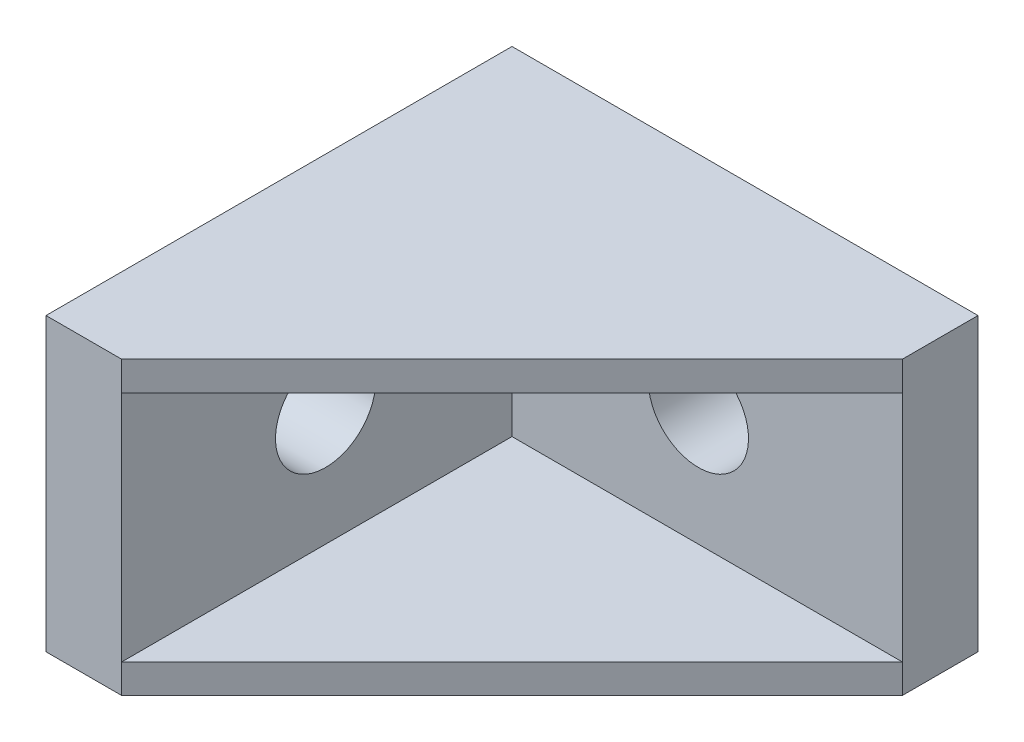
ISO-10303-21;
HEADER;
FILE_DESCRIPTION(('STEP AP214'),'2;1');
FILE_NAME('part.step','',(''),(''),'','','');
FILE_SCHEMA(('AUTOMOTIVE_DESIGN { 1 0 10303 214 1 1 1 1 }'));
ENDSEC;
DATA;
#1=APPLICATION_CONTEXT('core data for automotive mechanical design processes');
#2=APPLICATION_PROTOCOL_DEFINITION('international standard','automotive_design',2000,#1);
#3=PRODUCT_CONTEXT('',#1,'mechanical');
#4=PRODUCT('Part','Part','',(#3));
#5=PRODUCT_RELATED_PRODUCT_CATEGORY('part','',(#4));
#6=PRODUCT_DEFINITION_FORMATION('','',#4);
#7=PRODUCT_DEFINITION_CONTEXT('part definition',#1,'design');
#8=PRODUCT_DEFINITION('design','',#6,#7);
#9=PRODUCT_DEFINITION_SHAPE('','',#8);
#10=(LENGTH_UNIT() NAMED_UNIT(*) SI_UNIT(.MILLI.,.METRE.));
#11=(NAMED_UNIT(*) PLANE_ANGLE_UNIT() SI_UNIT($,.RADIAN.));
#12=(NAMED_UNIT(*) SI_UNIT($,.STERADIAN.) SOLID_ANGLE_UNIT());
#13=UNCERTAINTY_MEASURE_WITH_UNIT(LENGTH_MEASURE(1.E-05),#10,'distance_accuracy_value','');
#14=(GEOMETRIC_REPRESENTATION_CONTEXT(3) GLOBAL_UNCERTAINTY_ASSIGNED_CONTEXT((#13)) GLOBAL_UNIT_ASSIGNED_CONTEXT((#10,
#11,#12)) REPRESENTATION_CONTEXT('',''));
#15=CARTESIAN_POINT('',(0.,0.,0.));
#16=DIRECTION('',(0.,0.,1.));
#17=DIRECTION('',(1.,0.,0.));
#18=AXIS2_PLACEMENT_3D('',#15,#16,#17);
#19=CARTESIAN_POINT('',(20.,0.,-2.));
#20=DIRECTION('',(0.,0.,1.));
#21=DIRECTION('',(1.,0.,0.));
#22=AXIS2_PLACEMENT_3D('',#19,#20,#21);
#23=PLANE('',#22);
#24=DIRECTION('',(1.,0.,0.));
#25=VECTOR('',#24,1.);
#26=CARTESIAN_POINT('',(20.,4.1,-2.));
#27=LINE('',#26,#25);
#28=CARTESIAN_POINT('',(23.7961481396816,4.1,-2.));
#29=VERTEX_POINT('',#28);
#30=CARTESIAN_POINT('',(36.,4.1,-2.));
#31=VERTEX_POINT('',#30);
#32=EDGE_CURVE('E178',#29,#31,#27,.T.);
#33=ORIENTED_EDGE('',*,*,#32,.T.);
#34=DIRECTION('',(0.,1.,0.));
#35=VECTOR('',#34,1.);
#36=CARTESIAN_POINT('',(36.,0.,-2.));
#37=LINE('',#36,#35);
#38=CARTESIAN_POINT('',(36.,-4.1,-2.));
#39=VERTEX_POINT('',#38);
#40=EDGE_CURVE('E239',#31,#39,#37,.F.);
#41=ORIENTED_EDGE('',*,*,#40,.T.);
#42=DIRECTION('',(1.,0.,0.));
#43=VECTOR('',#42,1.);
#44=CARTESIAN_POINT('',(20.,-4.1,-2.));
#45=LINE('',#44,#43);
#46=CARTESIAN_POINT('',(23.7961481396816,-4.1,-2.));
#47=VERTEX_POINT('',#46);
#48=EDGE_CURVE('E174',#47,#39,#45,.T.);
#49=ORIENTED_EDGE('',*,*,#48,.F.);
#50=CARTESIAN_POINT('',(22.5,0.,-2.));
#51=DIRECTION('',(0.,0.,-1.));
#52=DIRECTION('',(0.,1.,0.));
#53=AXIS2_PLACEMENT_3D('',#50,#51,#52);
#54=CIRCLE('',#53,4.3);
#55=EDGE_CURVE('E18',#47,#29,#54,.F.);
#56=ORIENTED_EDGE('',*,*,#55,.T.);
#57=EDGE_LOOP('',(#33,#41,#49,#56));
#58=FACE_BOUND('',#57,.T.);
#59=ADVANCED_FACE('F15',(#58),#23,.F.);
#60=CARTESIAN_POINT('',(20.,0.,-2.));
#61=DIRECTION('',(0.,0.,1.));
#62=DIRECTION('',(1.,0.,0.));
#63=AXIS2_PLACEMENT_3D('',#60,#61,#62);
#64=PLANE('',#63);
#65=DIRECTION('',(1.,0.,0.));
#66=VECTOR('',#65,1.);
#67=CARTESIAN_POINT('',(20.,-4.1,-2.));
#68=LINE('',#67,#66);
#69=CARTESIAN_POINT('',(4.,-4.1,-2.));
#70=VERTEX_POINT('',#69);
#71=CARTESIAN_POINT('',(21.2038518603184,-4.1,-2.));
#72=VERTEX_POINT('',#71);
#73=EDGE_CURVE('E218',#70,#72,#68,.T.);
#74=ORIENTED_EDGE('',*,*,#73,.F.);
#75=DIRECTION('',(0.,1.,0.));
#76=VECTOR('',#75,1.);
#77=CARTESIAN_POINT('',(4.,0.,-2.));
#78=LINE('',#77,#76);
#79=CARTESIAN_POINT('',(4.,4.1,-2.));
#80=VERTEX_POINT('',#79);
#81=EDGE_CURVE('E210',#70,#80,#78,.T.);
#82=ORIENTED_EDGE('',*,*,#81,.T.);
#83=DIRECTION('',(1.,0.,0.));
#84=VECTOR('',#83,1.);
#85=CARTESIAN_POINT('',(20.,4.1,-2.));
#86=LINE('',#85,#84);
#87=CARTESIAN_POINT('',(21.2038518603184,4.1,-2.));
#88=VERTEX_POINT('',#87);
#89=EDGE_CURVE('E191',#80,#88,#86,.T.);
#90=ORIENTED_EDGE('',*,*,#89,.T.);
#91=CARTESIAN_POINT('',(22.5,0.,-2.));
#92=DIRECTION('',(0.,0.,-1.));
#93=DIRECTION('',(0.,1.,0.));
#94=AXIS2_PLACEMENT_3D('',#91,#92,#93);
#95=CIRCLE('',#94,4.3);
#96=EDGE_CURVE('E202',#88,#72,#95,.F.);
#97=ORIENTED_EDGE('',*,*,#96,.T.);
#98=EDGE_LOOP('',(#74,#82,#90,#97));
#99=FACE_BOUND('',#98,.T.);
#100=ADVANCED_FACE('F532',(#99),#64,.F.);
#101=CARTESIAN_POINT('',(15.5483714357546,10.,15.5483714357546));
#102=DIRECTION('',(0.,-1.,0.));
#103=DIRECTION('',(0.,0.,-1.));
#104=AXIS2_PLACEMENT_3D('',#101,#102,#103);
#105=PLANE('',#104);
#106=DIRECTION('',(-1.,0.,0.));
#107=VECTOR('',#106,1.);
#108=CARTESIAN_POINT('',(20.,10.,6.5));
#109=LINE('',#108,#107);
#110=CARTESIAN_POINT('',(6.5,10.,6.5));
#111=VERTEX_POINT('',#110);
#112=CARTESIAN_POINT('',(40.,10.,6.5));
#113=VERTEX_POINT('',#112);
#114=EDGE_CURVE('E276',#111,#113,#109,.F.);
#115=ORIENTED_EDGE('',*,*,#114,.T.);
#116=DIRECTION('',(0.707106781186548,0.,-0.707106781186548));
#117=VECTOR('',#116,1.);
#118=CARTESIAN_POINT('',(6.5,10.,40.));
#119=LINE('',#118,#117);
#120=CARTESIAN_POINT('',(6.5,10.,40.));
#121=VERTEX_POINT('',#120);
#122=EDGE_CURVE('E326',#121,#113,#119,.T.);
#123=ORIENTED_EDGE('',*,*,#122,.F.);
#124=DIRECTION('',(0.,0.,1.));
#125=VECTOR('',#124,1.);
#126=CARTESIAN_POINT('',(6.5,10.,20.));
#127=LINE('',#126,#125);
#128=EDGE_CURVE('E324',#121,#111,#127,.F.);
#129=ORIENTED_EDGE('',*,*,#128,.T.);
#130=EDGE_LOOP('',(#115,#123,#129));
#131=FACE_BOUND('',#130,.T.);
#132=ADVANCED_FACE('F459',(#131),#105,.T.);
#133=CARTESIAN_POINT('',(-2.,0.,20.));
#134=DIRECTION('',(1.,0.,0.));
#135=DIRECTION('',(0.,0.,-1.));
#136=AXIS2_PLACEMENT_3D('',#133,#134,#135);
#137=PLANE('',#136);
#138=DIRECTION('',(0.,0.,-1.));
#139=VECTOR('',#138,1.);
#140=CARTESIAN_POINT('',(-2.,4.1,20.));
#141=LINE('',#140,#139);
#142=CARTESIAN_POINT('',(-2.,4.1,21.2038518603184));
#143=VERTEX_POINT('',#142);
#144=CARTESIAN_POINT('',(-2.,4.1,4.));
#145=VERTEX_POINT('',#144);
#146=EDGE_CURVE('E226',#143,#145,#141,.T.);
#147=ORIENTED_EDGE('',*,*,#146,.T.);
#148=DIRECTION('',(0.,1.,0.));
#149=VECTOR('',#148,1.);
#150=CARTESIAN_POINT('',(-2.,0.,4.));
#151=LINE('',#150,#149);
#152=CARTESIAN_POINT('',(-2.,-4.1,4.));
#153=VERTEX_POINT('',#152);
#154=EDGE_CURVE('E234',#145,#153,#151,.F.);
#155=ORIENTED_EDGE('',*,*,#154,.T.);
#156=DIRECTION('',(0.,0.,-1.));
#157=VECTOR('',#156,1.);
#158=CARTESIAN_POINT('',(-2.,-4.1,20.));
#159=LINE('',#158,#157);
#160=CARTESIAN_POINT('',(-2.,-4.1,21.2038518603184));
#161=VERTEX_POINT('',#160);
#162=EDGE_CURVE('E230',#161,#153,#159,.T.);
#163=ORIENTED_EDGE('',*,*,#162,.F.);
#164=CARTESIAN_POINT('',(-2.,0.,22.5));
#165=DIRECTION('',(1.,0.,0.));
#166=DIRECTION('',(0.,0.,-1.));
#167=AXIS2_PLACEMENT_3D('',#164,#165,#166);
#168=CIRCLE('',#167,4.3);
#169=EDGE_CURVE('E269',#161,#143,#168,.T.);
#170=ORIENTED_EDGE('',*,*,#169,.T.);
#171=EDGE_LOOP('',(#147,#155,#163,#170));
#172=FACE_BOUND('',#171,.T.);
#173=ADVANCED_FACE('F435',(#172),#137,.F.);
#174=CARTESIAN_POINT('',(-2.,0.,20.));
#175=DIRECTION('',(1.,0.,0.));
#176=DIRECTION('',(0.,0.,-1.));
#177=AXIS2_PLACEMENT_3D('',#174,#175,#176);
#178=PLANE('',#177);
#179=DIRECTION('',(0.,0.,-1.));
#180=VECTOR('',#179,1.);
#181=CARTESIAN_POINT('',(-2.,-4.1,20.));
#182=LINE('',#181,#180);
#183=CARTESIAN_POINT('',(-2.,-4.1,36.));
#184=VERTEX_POINT('',#183);
#185=CARTESIAN_POINT('',(-2.,-4.1,23.7961481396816));
#186=VERTEX_POINT('',#185);
#187=EDGE_CURVE('E219',#184,#186,#182,.T.);
#188=ORIENTED_EDGE('',*,*,#187,.F.);
#189=DIRECTION('',(0.,1.,0.));
#190=VECTOR('',#189,1.);
#191=CARTESIAN_POINT('',(-2.,0.,36.));
#192=LINE('',#191,#190);
#193=CARTESIAN_POINT('',(-2.,4.1,36.));
#194=VERTEX_POINT('',#193);
#195=EDGE_CURVE('E236',#184,#194,#192,.T.);
#196=ORIENTED_EDGE('',*,*,#195,.T.);
#197=DIRECTION('',(0.,0.,-1.));
#198=VECTOR('',#197,1.);
#199=CARTESIAN_POINT('',(-2.,4.1,20.));
#200=LINE('',#199,#198);
#201=CARTESIAN_POINT('',(-2.,4.1,23.7961481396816));
#202=VERTEX_POINT('',#201);
#203=EDGE_CURVE('E224',#194,#202,#200,.T.);
#204=ORIENTED_EDGE('',*,*,#203,.T.);
#205=CARTESIAN_POINT('',(-2.,0.,22.5));
#206=DIRECTION('',(1.,0.,0.));
#207=DIRECTION('',(0.,0.,-1.));
#208=AXIS2_PLACEMENT_3D('',#205,#206,#207);
#209=CIRCLE('',#208,4.3);
#210=EDGE_CURVE('E266',#202,#186,#209,.T.);
#211=ORIENTED_EDGE('',*,*,#210,.T.);
#212=EDGE_LOOP('',(#188,#196,#204,#211));
#213=FACE_BOUND('',#212,.T.);
#214=ADVANCED_FACE('F448',(#213),#178,.F.);
#215=CARTESIAN_POINT('',(20.,-4.1,-1.));
#216=DIRECTION('',(0.,-1.,0.));
#217=DIRECTION('',(0.,0.,-1.));
#218=AXIS2_PLACEMENT_3D('',#215,#216,#217);
#219=PLANE('',#218);
#220=DIRECTION('',(0.,0.,-1.));
#221=VECTOR('',#220,1.);
#222=CARTESIAN_POINT('',(4.,-4.1,-1.));
#223=LINE('',#222,#221);
#224=CARTESIAN_POINT('',(4.,-4.1,0.));
#225=VERTEX_POINT('',#224);
#226=EDGE_CURVE('E215',#225,#70,#223,.T.);
#227=ORIENTED_EDGE('',*,*,#226,.T.);
#228=ORIENTED_EDGE('',*,*,#73,.T.);
#229=DIRECTION('',(0.,0.,-1.));
#230=VECTOR('',#229,1.);
#231=CARTESIAN_POINT('',(21.2038518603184,-4.1,2.25));
#232=LINE('',#231,#230);
#233=CARTESIAN_POINT('',(21.2038518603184,-4.1,0.));
#234=VERTEX_POINT('',#233);
#235=EDGE_CURVE('E277',#72,#234,#232,.F.);
#236=ORIENTED_EDGE('',*,*,#235,.T.);
#237=DIRECTION('',(1.,0.,0.));
#238=VECTOR('',#237,1.);
#239=CARTESIAN_POINT('',(20.,-4.1,0.));
#240=LINE('',#239,#238);
#241=EDGE_CURVE('E214',#234,#225,#240,.F.);
#242=ORIENTED_EDGE('',*,*,#241,.T.);
#243=EDGE_LOOP('',(#227,#228,#236,#242));
#244=FACE_BOUND('',#243,.T.);
#245=ADVANCED_FACE('F450',(#244),#219,.T.);
#246=CARTESIAN_POINT('',(4.,0.,-1.));
#247=DIRECTION('',(1.,0.,0.));
#248=DIRECTION('',(0.,0.,-1.));
#249=AXIS2_PLACEMENT_3D('',#246,#247,#248);
#250=PLANE('',#249);
#251=DIRECTION('',(0.,0.,-1.));
#252=VECTOR('',#251,1.);
#253=CARTESIAN_POINT('',(4.,4.1,-1.));
#254=LINE('',#253,#252);
#255=CARTESIAN_POINT('',(4.,4.1,0.));
#256=VERTEX_POINT('',#255);
#257=EDGE_CURVE('E207',#256,#80,#254,.T.);
#258=ORIENTED_EDGE('',*,*,#257,.T.);
#259=ORIENTED_EDGE('',*,*,#81,.F.);
#260=ORIENTED_EDGE('',*,*,#226,.F.);
#261=DIRECTION('',(0.,1.,0.));
#262=VECTOR('',#261,1.);
#263=CARTESIAN_POINT('',(4.,0.,0.));
#264=LINE('',#263,#262);
#265=EDGE_CURVE('E211',#225,#256,#264,.T.);
#266=ORIENTED_EDGE('',*,*,#265,.T.);
#267=EDGE_LOOP('',(#258,#259,#260,#266));
#268=FACE_BOUND('',#267,.T.);
#269=ADVANCED_FACE('F457',(#268),#250,.F.);
#270=CARTESIAN_POINT('',(20.,4.1,-1.));
#271=DIRECTION('',(0.,-1.,0.));
#272=DIRECTION('',(0.,0.,-1.));
#273=AXIS2_PLACEMENT_3D('',#270,#271,#272);
#274=PLANE('',#273);
#275=ORIENTED_EDGE('',*,*,#89,.F.);
#276=ORIENTED_EDGE('',*,*,#257,.F.);
#277=DIRECTION('',(1.,0.,0.));
#278=VECTOR('',#277,1.);
#279=CARTESIAN_POINT('',(20.,4.1,0.));
#280=LINE('',#279,#278);
#281=CARTESIAN_POINT('',(21.2038518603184,4.1,0.));
#282=VERTEX_POINT('',#281);
#283=EDGE_CURVE('E213',#256,#282,#280,.T.);
#284=ORIENTED_EDGE('',*,*,#283,.T.);
#285=DIRECTION('',(0.,0.,-1.));
#286=VECTOR('',#285,1.);
#287=CARTESIAN_POINT('',(21.2038518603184,4.1,2.25));
#288=LINE('',#287,#286);
#289=EDGE_CURVE('E199',#282,#88,#288,.T.);
#290=ORIENTED_EDGE('',*,*,#289,.T.);
#291=EDGE_LOOP('',(#275,#276,#284,#290));
#292=FACE_BOUND('',#291,.T.);
#293=ADVANCED_FACE('F518',(#292),#274,.F.);
#294=CARTESIAN_POINT('',(20.,4.1,-1.));
#295=DIRECTION('',(0.,-1.,0.));
#296=DIRECTION('',(0.,0.,-1.));
#297=AXIS2_PLACEMENT_3D('',#294,#295,#296);
#298=PLANE('',#297);
#299=DIRECTION('',(1.,0.,0.));
#300=VECTOR('',#299,1.);
#301=CARTESIAN_POINT('',(20.,4.1,0.));
#302=LINE('',#301,#300);
#303=CARTESIAN_POINT('',(23.7961481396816,4.1,0.));
#304=VERTEX_POINT('',#303);
#305=CARTESIAN_POINT('',(36.,4.1,0.));
#306=VERTEX_POINT('',#305);
#307=EDGE_CURVE('E260',#304,#306,#302,.T.);
#308=ORIENTED_EDGE('',*,*,#307,.T.);
#309=DIRECTION('',(0.,0.,1.));
#310=VECTOR('',#309,1.);
#311=CARTESIAN_POINT('',(36.,4.1,-1.));
#312=LINE('',#311,#310);
#313=EDGE_CURVE('E189',#306,#31,#312,.F.);
#314=ORIENTED_EDGE('',*,*,#313,.T.);
#315=ORIENTED_EDGE('',*,*,#32,.F.);
#316=DIRECTION('',(0.,0.,-1.));
#317=VECTOR('',#316,1.);
#318=CARTESIAN_POINT('',(23.7961481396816,4.1,2.25));
#319=LINE('',#318,#317);
#320=EDGE_CURVE('E183',#29,#304,#319,.F.);
#321=ORIENTED_EDGE('',*,*,#320,.T.);
#322=EDGE_LOOP('',(#308,#314,#315,#321));
#323=FACE_BOUND('',#322,.T.);
#324=ADVANCED_FACE('F186',(#323),#298,.F.);
#325=CARTESIAN_POINT('',(36.,0.,-1.));
#326=DIRECTION('',(-1.,0.,0.));
#327=DIRECTION('',(0.,0.,1.));
#328=AXIS2_PLACEMENT_3D('',#325,#326,#327);
#329=PLANE('',#328);
#330=ORIENTED_EDGE('',*,*,#313,.F.);
#331=DIRECTION('',(0.,1.,0.));
#332=VECTOR('',#331,1.);
#333=CARTESIAN_POINT('',(36.,0.,0.));
#334=LINE('',#333,#332);
#335=CARTESIAN_POINT('',(36.,-4.1,0.));
#336=VERTEX_POINT('',#335);
#337=EDGE_CURVE('E289',#306,#336,#334,.F.);
#338=ORIENTED_EDGE('',*,*,#337,.T.);
#339=DIRECTION('',(0.,0.,-1.));
#340=VECTOR('',#339,1.);
#341=CARTESIAN_POINT('',(36.,-4.1,-1.));
#342=LINE('',#341,#340);
#343=EDGE_CURVE('E184',#39,#336,#342,.F.);
#344=ORIENTED_EDGE('',*,*,#343,.F.);
#345=ORIENTED_EDGE('',*,*,#40,.F.);
#346=EDGE_LOOP('',(#330,#338,#344,#345));
#347=FACE_BOUND('',#346,.T.);
#348=ADVANCED_FACE('F512',(#347),#329,.F.);
#349=CARTESIAN_POINT('',(20.,-4.1,-1.));
#350=DIRECTION('',(0.,-1.,0.));
#351=DIRECTION('',(0.,0.,-1.));
#352=AXIS2_PLACEMENT_3D('',#349,#350,#351);
#353=PLANE('',#352);
#354=ORIENTED_EDGE('',*,*,#343,.T.);
#355=DIRECTION('',(1.,0.,0.));
#356=VECTOR('',#355,1.);
#357=CARTESIAN_POINT('',(20.,-4.1,0.));
#358=LINE('',#357,#356);
#359=CARTESIAN_POINT('',(23.7961481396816,-4.1,0.));
#360=VERTEX_POINT('',#359);
#361=EDGE_CURVE('E258',#336,#360,#358,.F.);
#362=ORIENTED_EDGE('',*,*,#361,.T.);
#363=DIRECTION('',(0.,0.,-1.));
#364=VECTOR('',#363,1.);
#365=CARTESIAN_POINT('',(23.7961481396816,-4.1,2.25));
#366=LINE('',#365,#364);
#367=EDGE_CURVE('E280',#360,#47,#366,.T.);
#368=ORIENTED_EDGE('',*,*,#367,.T.);
#369=ORIENTED_EDGE('',*,*,#48,.T.);
#370=EDGE_LOOP('',(#354,#362,#368,#369));
#371=FACE_BOUND('',#370,.T.);
#372=ADVANCED_FACE('F508',(#371),#353,.T.);
#373=CARTESIAN_POINT('',(22.5,0.,2.25));
#374=DIRECTION('',(0.,0.,-1.));
#375=DIRECTION('',(0.,1.,0.));
#376=AXIS2_PLACEMENT_3D('',#373,#374,#375);
#377=CYLINDRICAL_SURFACE('',#376,4.3);
#378=CARTESIAN_POINT('',(22.5,0.,6.5));
#379=DIRECTION('',(0.,0.,-1.));
#380=DIRECTION('',(0.,1.,0.));
#381=AXIS2_PLACEMENT_3D('',#378,#379,#380);
#382=CIRCLE('',#381,4.3);
#383=CARTESIAN_POINT('',(22.5,4.3,6.5));
#384=VERTEX_POINT('',#383);
#385=EDGE_CURVE('E273',#384,#384,#382,.F.);
#386=ORIENTED_EDGE('',*,*,#385,.T.);
#387=EDGE_LOOP('',(#386));
#388=FACE_BOUND('',#387,.T.);
#389=CARTESIAN_POINT('',(22.5,0.,0.));
#390=DIRECTION('',(0.,0.,-1.));
#391=DIRECTION('',(0.,1.,0.));
#392=AXIS2_PLACEMENT_3D('',#389,#390,#391);
#393=CIRCLE('',#392,4.3);
#394=EDGE_CURVE('E255',#360,#234,#393,.T.);
#395=ORIENTED_EDGE('',*,*,#394,.T.);
#396=ORIENTED_EDGE('',*,*,#235,.F.);
#397=ORIENTED_EDGE('',*,*,#96,.F.);
#398=ORIENTED_EDGE('',*,*,#289,.F.);
#399=CARTESIAN_POINT('',(22.5,0.,0.));
#400=DIRECTION('',(0.,0.,-1.));
#401=DIRECTION('',(0.,1.,0.));
#402=AXIS2_PLACEMENT_3D('',#399,#400,#401);
#403=CIRCLE('',#402,4.3);
#404=EDGE_CURVE('E197',#282,#304,#403,.T.);
#405=ORIENTED_EDGE('',*,*,#404,.T.);
#406=ORIENTED_EDGE('',*,*,#320,.F.);
#407=ORIENTED_EDGE('',*,*,#55,.F.);
#408=ORIENTED_EDGE('',*,*,#367,.F.);
#409=EDGE_LOOP('',(#395,#396,#397,#398,#405,#406,#407,#408));
#410=FACE_BOUND('',#409,.T.);
#411=ADVANCED_FACE('F194',(#388,#410),#377,.F.);
#412=CARTESIAN_POINT('',(20.,0.,6.5));
#413=DIRECTION('',(0.,0.,-1.));
#414=DIRECTION('',(-1.,0.,0.));
#415=AXIS2_PLACEMENT_3D('',#412,#413,#414);
#416=PLANE('',#415);
#417=ORIENTED_EDGE('',*,*,#385,.F.);
#418=EDGE_LOOP('',(#417));
#419=FACE_BOUND('',#418,.T.);
#420=DIRECTION('',(0.,1.,0.));
#421=VECTOR('',#420,1.);
#422=CARTESIAN_POINT('',(40.,0.,6.5));
#423=LINE('',#422,#421);
#424=CARTESIAN_POINT('',(40.,-10.,6.5));
#425=VERTEX_POINT('',#424);
#426=EDGE_CURVE('E257',#425,#113,#423,.T.);
#427=ORIENTED_EDGE('',*,*,#426,.T.);
#428=ORIENTED_EDGE('',*,*,#114,.F.);
#429=DIRECTION('',(0.,1.,0.));
#430=VECTOR('',#429,1.);
#431=CARTESIAN_POINT('',(6.5,0.,6.5));
#432=LINE('',#431,#430);
#433=CARTESIAN_POINT('',(6.5,-10.,6.5));
#434=VERTEX_POINT('',#433);
#435=EDGE_CURVE('E322',#111,#434,#432,.F.);
#436=ORIENTED_EDGE('',*,*,#435,.T.);
#437=DIRECTION('',(1.,0.,0.));
#438=VECTOR('',#437,1.);
#439=CARTESIAN_POINT('',(15.5483714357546,-10.,6.5));
#440=LINE('',#439,#438);
#441=EDGE_CURVE('E275',#434,#425,#440,.T.);
#442=ORIENTED_EDGE('',*,*,#441,.T.);
#443=EDGE_LOOP('',(#427,#428,#436,#442));
#444=FACE_BOUND('',#443,.T.);
#445=ADVANCED_FACE('F332',(#419,#444),#416,.F.);
#446=CARTESIAN_POINT('',(15.5483714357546,-10.,15.5483714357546));
#447=DIRECTION('',(0.,-1.,0.));
#448=DIRECTION('',(0.,0.,-1.));
#449=AXIS2_PLACEMENT_3D('',#446,#447,#448);
#450=PLANE('',#449);
#451=DIRECTION('',(0.707106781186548,0.,-0.707106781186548));
#452=VECTOR('',#451,1.);
#453=CARTESIAN_POINT('',(6.5,-10.,40.));
#454=LINE('',#453,#452);
#455=CARTESIAN_POINT('',(6.5,-10.,40.));
#456=VERTEX_POINT('',#455);
#457=EDGE_CURVE('E348',#425,#456,#454,.F.);
#458=ORIENTED_EDGE('',*,*,#457,.F.);
#459=ORIENTED_EDGE('',*,*,#441,.F.);
#460=DIRECTION('',(0.,0.,1.));
#461=VECTOR('',#460,1.);
#462=CARTESIAN_POINT('',(6.5,-10.,20.));
#463=LINE('',#462,#461);
#464=EDGE_CURVE('E320',#434,#456,#463,.T.);
#465=ORIENTED_EDGE('',*,*,#464,.T.);
#466=EDGE_LOOP('',(#458,#459,#465));
#467=FACE_BOUND('',#466,.T.);
#468=ADVANCED_FACE('F349',(#467),#450,.F.);
#469=CARTESIAN_POINT('',(6.5,12.5,40.));
#470=DIRECTION('',(0.707106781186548,0.,0.707106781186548));
#471=DIRECTION('',(0.707106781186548,0.,-0.707106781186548));
#472=AXIS2_PLACEMENT_3D('',#469,#470,#471);
#473=PLANE('',#472);
#474=DIRECTION('',(-0.707106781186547,0.,0.707106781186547));
#475=VECTOR('',#474,1.);
#476=CARTESIAN_POINT('',(40.,12.5,6.5));
#477=LINE('',#476,#475);
#478=CARTESIAN_POINT('',(40.,12.5,6.5));
#479=VERTEX_POINT('',#478);
#480=CARTESIAN_POINT('',(6.5,12.5,40.));
#481=VERTEX_POINT('',#480);
#482=EDGE_CURVE('E223',#479,#481,#477,.T.);
#483=ORIENTED_EDGE('',*,*,#482,.T.);
#484=DIRECTION('',(0.,1.,0.));
#485=VECTOR('',#484,1.);
#486=CARTESIAN_POINT('',(6.5,0.,40.));
#487=LINE('',#486,#485);
#488=EDGE_CURVE('E389',#481,#121,#487,.F.);
#489=ORIENTED_EDGE('',*,*,#488,.T.);
#490=ORIENTED_EDGE('',*,*,#122,.T.);
#491=DIRECTION('',(0.,1.,0.));
#492=VECTOR('',#491,1.);
#493=CARTESIAN_POINT('',(40.,0.,6.5));
#494=LINE('',#493,#492);
#495=EDGE_CURVE('E346',#113,#479,#494,.T.);
#496=ORIENTED_EDGE('',*,*,#495,.T.);
#497=EDGE_LOOP('',(#483,#489,#490,#496));
#498=FACE_BOUND('',#497,.T.);
#499=ADVANCED_FACE('F367',(#498),#473,.T.);
#500=CARTESIAN_POINT('',(6.5,0.,20.));
#501=DIRECTION('',(-1.,0.,0.));
#502=DIRECTION('',(0.,0.,1.));
#503=AXIS2_PLACEMENT_3D('',#500,#501,#502);
#504=PLANE('',#503);
#505=CARTESIAN_POINT('',(6.5,0.,22.5));
#506=DIRECTION('',(1.,0.,0.));
#507=DIRECTION('',(0.,0.,-1.));
#508=AXIS2_PLACEMENT_3D('',#505,#506,#507);
#509=CIRCLE('',#508,4.3);
#510=CARTESIAN_POINT('',(6.5,0.,18.2));
#511=VERTEX_POINT('',#510);
#512=EDGE_CURVE('E261',#511,#511,#509,.F.);
#513=ORIENTED_EDGE('',*,*,#512,.T.);
#514=EDGE_LOOP('',(#513));
#515=FACE_BOUND('',#514,.T.);
#516=ORIENTED_EDGE('',*,*,#435,.F.);
#517=ORIENTED_EDGE('',*,*,#128,.F.);
#518=DIRECTION('',(0.,1.,0.));
#519=VECTOR('',#518,1.);
#520=CARTESIAN_POINT('',(6.5,0.,40.));
#521=LINE('',#520,#519);
#522=EDGE_CURVE('E398',#121,#456,#521,.F.);
#523=ORIENTED_EDGE('',*,*,#522,.T.);
#524=ORIENTED_EDGE('',*,*,#464,.F.);
#525=EDGE_LOOP('',(#516,#517,#523,#524));
#526=FACE_BOUND('',#525,.T.);
#527=ADVANCED_FACE('F495',(#515,#526),#504,.F.);
#528=CARTESIAN_POINT('',(20.,12.5,3.25));
#529=DIRECTION('',(0.,-1.,0.));
#530=DIRECTION('',(0.,0.,-1.));
#531=AXIS2_PLACEMENT_3D('',#528,#529,#530);
#532=PLANE('',#531);
#533=DIRECTION('',(1.,0.,0.));
#534=VECTOR('',#533,1.);
#535=CARTESIAN_POINT('',(20.,12.5,0.));
#536=LINE('',#535,#534);
#537=CARTESIAN_POINT('',(40.,12.5,0.));
#538=VERTEX_POINT('',#537);
#539=CARTESIAN_POINT('',(0.,12.5,0.));
#540=VERTEX_POINT('',#539);
#541=EDGE_CURVE('E264',#538,#540,#536,.F.);
#542=ORIENTED_EDGE('',*,*,#541,.T.);
#543=DIRECTION('',(0.,0.,-1.));
#544=VECTOR('',#543,1.);
#545=CARTESIAN_POINT('',(0.,12.5,3.25));
#546=LINE('',#545,#544);
#547=CARTESIAN_POINT('',(0.,12.5,40.));
#548=VERTEX_POINT('',#547);
#549=EDGE_CURVE('E384',#540,#548,#546,.F.);
#550=ORIENTED_EDGE('',*,*,#549,.T.);
#551=DIRECTION('',(-1.,0.,0.));
#552=VECTOR('',#551,1.);
#553=CARTESIAN_POINT('',(3.25,12.5,40.));
#554=LINE('',#553,#552);
#555=EDGE_CURVE('E373',#548,#481,#554,.F.);
#556=ORIENTED_EDGE('',*,*,#555,.T.);
#557=ORIENTED_EDGE('',*,*,#482,.F.);
#558=DIRECTION('',(0.,0.,1.));
#559=VECTOR('',#558,1.);
#560=CARTESIAN_POINT('',(40.,12.5,3.25));
#561=LINE('',#560,#559);
#562=EDGE_CURVE('E360',#479,#538,#561,.F.);
#563=ORIENTED_EDGE('',*,*,#562,.T.);
#564=EDGE_LOOP('',(#542,#550,#556,#557,#563));
#565=FACE_BOUND('',#564,.T.);
#566=ADVANCED_FACE('F371',(#565),#532,.F.);
#567=CARTESIAN_POINT('',(-1.,-4.1,20.));
#568=DIRECTION('',(0.,-1.,0.));
#569=DIRECTION('',(0.,0.,-1.));
#570=AXIS2_PLACEMENT_3D('',#567,#568,#569);
#571=PLANE('',#570);
#572=DIRECTION('',(-1.,0.,0.));
#573=VECTOR('',#572,1.);
#574=CARTESIAN_POINT('',(-1.,-4.1,36.));
#575=LINE('',#574,#573);
#576=CARTESIAN_POINT('',(0.,-4.1,36.));
#577=VERTEX_POINT('',#576);
#578=EDGE_CURVE('E222',#577,#184,#575,.T.);
#579=ORIENTED_EDGE('',*,*,#578,.T.);
#580=ORIENTED_EDGE('',*,*,#187,.T.);
#581=DIRECTION('',(1.,0.,0.));
#582=VECTOR('',#581,1.);
#583=CARTESIAN_POINT('',(2.25,-4.1,23.7961481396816));
#584=LINE('',#583,#582);
#585=CARTESIAN_POINT('',(0.,-4.1,23.7961481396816));
#586=VERTEX_POINT('',#585);
#587=EDGE_CURVE('E265',#186,#586,#584,.T.);
#588=ORIENTED_EDGE('',*,*,#587,.T.);
#589=DIRECTION('',(0.,0.,-1.));
#590=VECTOR('',#589,1.);
#591=CARTESIAN_POINT('',(0.,-4.1,3.25));
#592=LINE('',#591,#590);
#593=EDGE_CURVE('E316',#586,#577,#592,.F.);
#594=ORIENTED_EDGE('',*,*,#593,.T.);
#595=EDGE_LOOP('',(#579,#580,#588,#594));
#596=FACE_BOUND('',#595,.T.);
#597=ADVANCED_FACE('F443',(#596),#571,.T.);
#598=CARTESIAN_POINT('',(-1.,0.,36.));
#599=DIRECTION('',(0.,0.,-1.));
#600=DIRECTION('',(-1.,0.,0.));
#601=AXIS2_PLACEMENT_3D('',#598,#599,#600);
#602=PLANE('',#601);
#603=DIRECTION('',(1.,0.,0.));
#604=VECTOR('',#603,1.);
#605=CARTESIAN_POINT('',(-1.,4.1,36.));
#606=LINE('',#605,#604);
#607=CARTESIAN_POINT('',(0.,4.1,36.));
#608=VERTEX_POINT('',#607);
#609=EDGE_CURVE('E227',#608,#194,#606,.F.);
#610=ORIENTED_EDGE('',*,*,#609,.T.);
#611=ORIENTED_EDGE('',*,*,#195,.F.);
#612=ORIENTED_EDGE('',*,*,#578,.F.);
#613=DIRECTION('',(0.,1.,0.));
#614=VECTOR('',#613,1.);
#615=CARTESIAN_POINT('',(0.,0.,36.));
#616=LINE('',#615,#614);
#617=EDGE_CURVE('E314',#577,#608,#616,.T.);
#618=ORIENTED_EDGE('',*,*,#617,.T.);
#619=EDGE_LOOP('',(#610,#611,#612,#618));
#620=FACE_BOUND('',#619,.T.);
#621=ADVANCED_FACE('F446',(#620),#602,.F.);
#622=CARTESIAN_POINT('',(-1.,4.1,20.));
#623=DIRECTION('',(0.,-1.,0.));
#624=DIRECTION('',(0.,0.,-1.));
#625=AXIS2_PLACEMENT_3D('',#622,#623,#624);
#626=PLANE('',#625);
#627=ORIENTED_EDGE('',*,*,#203,.F.);
#628=ORIENTED_EDGE('',*,*,#609,.F.);
#629=DIRECTION('',(0.,0.,-1.));
#630=VECTOR('',#629,1.);
#631=CARTESIAN_POINT('',(0.,4.1,3.25));
#632=LINE('',#631,#630);
#633=CARTESIAN_POINT('',(0.,4.1,23.7961481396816));
#634=VERTEX_POINT('',#633);
#635=EDGE_CURVE('E254',#608,#634,#632,.T.);
#636=ORIENTED_EDGE('',*,*,#635,.T.);
#637=DIRECTION('',(1.,0.,0.));
#638=VECTOR('',#637,1.);
#639=CARTESIAN_POINT('',(2.25,4.1,23.7961481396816));
#640=LINE('',#639,#638);
#641=EDGE_CURVE('E268',#634,#202,#640,.F.);
#642=ORIENTED_EDGE('',*,*,#641,.T.);
#643=EDGE_LOOP('',(#627,#628,#636,#642));
#644=FACE_BOUND('',#643,.T.);
#645=ADVANCED_FACE('F414',(#644),#626,.F.);
#646=CARTESIAN_POINT('',(-1.,4.1,20.));
#647=DIRECTION('',(0.,-1.,0.));
#648=DIRECTION('',(0.,0.,-1.));
#649=AXIS2_PLACEMENT_3D('',#646,#647,#648);
#650=PLANE('',#649);
#651=DIRECTION('',(0.,0.,-1.));
#652=VECTOR('',#651,1.);
#653=CARTESIAN_POINT('',(0.,4.1,3.25));
#654=LINE('',#653,#652);
#655=CARTESIAN_POINT('',(0.,4.1,21.2038518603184));
#656=VERTEX_POINT('',#655);
#657=CARTESIAN_POINT('',(0.,4.1,4.));
#658=VERTEX_POINT('',#657);
#659=EDGE_CURVE('E253',#656,#658,#654,.T.);
#660=ORIENTED_EDGE('',*,*,#659,.T.);
#661=DIRECTION('',(1.,0.,0.));
#662=VECTOR('',#661,1.);
#663=CARTESIAN_POINT('',(-1.,4.1,4.));
#664=LINE('',#663,#662);
#665=EDGE_CURVE('E229',#658,#145,#664,.F.);
#666=ORIENTED_EDGE('',*,*,#665,.T.);
#667=ORIENTED_EDGE('',*,*,#146,.F.);
#668=DIRECTION('',(1.,0.,0.));
#669=VECTOR('',#668,1.);
#670=CARTESIAN_POINT('',(2.25,4.1,21.2038518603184));
#671=LINE('',#670,#669);
#672=EDGE_CURVE('E271',#143,#656,#671,.T.);
#673=ORIENTED_EDGE('',*,*,#672,.T.);
#674=EDGE_LOOP('',(#660,#666,#667,#673));
#675=FACE_BOUND('',#674,.T.);
#676=ADVANCED_FACE('F428',(#675),#650,.F.);
#677=CARTESIAN_POINT('',(-1.,0.,4.));
#678=DIRECTION('',(0.,0.,1.));
#679=DIRECTION('',(1.,0.,0.));
#680=AXIS2_PLACEMENT_3D('',#677,#678,#679);
#681=PLANE('',#680);
#682=ORIENTED_EDGE('',*,*,#665,.F.);
#683=DIRECTION('',(0.,1.,0.));
#684=VECTOR('',#683,1.);
#685=CARTESIAN_POINT('',(0.,0.,4.));
#686=LINE('',#685,#684);
#687=CARTESIAN_POINT('',(0.,-4.1,4.));
#688=VERTEX_POINT('',#687);
#689=EDGE_CURVE('E305',#658,#688,#686,.F.);
#690=ORIENTED_EDGE('',*,*,#689,.T.);
#691=DIRECTION('',(1.,0.,0.));
#692=VECTOR('',#691,1.);
#693=CARTESIAN_POINT('',(-1.,-4.1,4.));
#694=LINE('',#693,#692);
#695=EDGE_CURVE('E233',#153,#688,#694,.T.);
#696=ORIENTED_EDGE('',*,*,#695,.F.);
#697=ORIENTED_EDGE('',*,*,#154,.F.);
#698=EDGE_LOOP('',(#682,#690,#696,#697));
#699=FACE_BOUND('',#698,.T.);
#700=ADVANCED_FACE('F432',(#699),#681,.F.);
#701=CARTESIAN_POINT('',(-1.,-4.1,20.));
#702=DIRECTION('',(0.,-1.,0.));
#703=DIRECTION('',(0.,0.,-1.));
#704=AXIS2_PLACEMENT_3D('',#701,#702,#703);
#705=PLANE('',#704);
#706=ORIENTED_EDGE('',*,*,#695,.T.);
#707=DIRECTION('',(0.,0.,-1.));
#708=VECTOR('',#707,1.);
#709=CARTESIAN_POINT('',(0.,-4.1,3.25));
#710=LINE('',#709,#708);
#711=CARTESIAN_POINT('',(0.,-4.1,21.2038518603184));
#712=VERTEX_POINT('',#711);
#713=EDGE_CURVE('E249',#688,#712,#710,.F.);
#714=ORIENTED_EDGE('',*,*,#713,.T.);
#715=DIRECTION('',(1.,0.,0.));
#716=VECTOR('',#715,1.);
#717=CARTESIAN_POINT('',(2.25,-4.1,21.2038518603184));
#718=LINE('',#717,#716);
#719=EDGE_CURVE('E272',#712,#161,#718,.F.);
#720=ORIENTED_EDGE('',*,*,#719,.T.);
#721=ORIENTED_EDGE('',*,*,#162,.T.);
#722=EDGE_LOOP('',(#706,#714,#720,#721));
#723=FACE_BOUND('',#722,.T.);
#724=ADVANCED_FACE('F479',(#723),#705,.T.);
#725=CARTESIAN_POINT('',(2.25,0.,22.5));
#726=DIRECTION('',(1.,0.,0.));
#727=DIRECTION('',(0.,0.,-1.));
#728=AXIS2_PLACEMENT_3D('',#725,#726,#727);
#729=CYLINDRICAL_SURFACE('',#728,4.3);
#730=ORIENTED_EDGE('',*,*,#512,.F.);
#731=EDGE_LOOP('',(#730));
#732=FACE_BOUND('',#731,.T.);
#733=ORIENTED_EDGE('',*,*,#210,.F.);
#734=ORIENTED_EDGE('',*,*,#641,.F.);
#735=CARTESIAN_POINT('',(0.,0.,22.5));
#736=DIRECTION('',(1.,0.,0.));
#737=DIRECTION('',(0.,0.,-1.));
#738=AXIS2_PLACEMENT_3D('',#735,#736,#737);
#739=CIRCLE('',#738,4.3);
#740=EDGE_CURVE('E250',#634,#656,#739,.F.);
#741=ORIENTED_EDGE('',*,*,#740,.T.);
#742=ORIENTED_EDGE('',*,*,#672,.F.);
#743=ORIENTED_EDGE('',*,*,#169,.F.);
#744=ORIENTED_EDGE('',*,*,#719,.F.);
#745=CARTESIAN_POINT('',(0.,0.,22.5));
#746=DIRECTION('',(1.,0.,0.));
#747=DIRECTION('',(0.,0.,-1.));
#748=AXIS2_PLACEMENT_3D('',#745,#746,#747);
#749=CIRCLE('',#748,4.3);
#750=EDGE_CURVE('E245',#712,#586,#749,.F.);
#751=ORIENTED_EDGE('',*,*,#750,.T.);
#752=ORIENTED_EDGE('',*,*,#587,.F.);
#753=EDGE_LOOP('',(#733,#734,#741,#742,#743,#744,#751,#752));
#754=FACE_BOUND('',#753,.T.);
#755=ADVANCED_FACE('F420',(#732,#754),#729,.F.);
#756=CARTESIAN_POINT('',(20.,0.,0.));
#757=DIRECTION('',(0.,0.,1.));
#758=DIRECTION('',(1.,0.,0.));
#759=AXIS2_PLACEMENT_3D('',#756,#757,#758);
#760=PLANE('',#759);
#761=ORIENTED_EDGE('',*,*,#361,.F.);
#762=ORIENTED_EDGE('',*,*,#337,.F.);
#763=ORIENTED_EDGE('',*,*,#307,.F.);
#764=ORIENTED_EDGE('',*,*,#404,.F.);
#765=ORIENTED_EDGE('',*,*,#283,.F.);
#766=ORIENTED_EDGE('',*,*,#265,.F.);
#767=ORIENTED_EDGE('',*,*,#241,.F.);
#768=ORIENTED_EDGE('',*,*,#394,.F.);
#769=EDGE_LOOP('',(#761,#762,#763,#764,#765,#766,#767,#768));
#770=FACE_BOUND('',#769,.T.);
#771=ORIENTED_EDGE('',*,*,#541,.F.);
#772=DIRECTION('',(0.,1.,0.));
#773=VECTOR('',#772,1.);
#774=CARTESIAN_POINT('',(40.,0.,0.));
#775=LINE('',#774,#773);
#776=CARTESIAN_POINT('',(40.,-12.5,0.));
#777=VERTEX_POINT('',#776);
#778=EDGE_CURVE('E358',#538,#777,#775,.F.);
#779=ORIENTED_EDGE('',*,*,#778,.T.);
#780=DIRECTION('',(1.,0.,0.));
#781=VECTOR('',#780,1.);
#782=CARTESIAN_POINT('',(20.,-12.5,0.));
#783=LINE('',#782,#781);
#784=CARTESIAN_POINT('',(0.,-12.5,0.));
#785=VERTEX_POINT('',#784);
#786=EDGE_CURVE('E248',#785,#777,#783,.T.);
#787=ORIENTED_EDGE('',*,*,#786,.F.);
#788=DIRECTION('',(0.,1.,0.));
#789=VECTOR('',#788,1.);
#790=CARTESIAN_POINT('',(0.,0.,0.));
#791=LINE('',#790,#789);
#792=EDGE_CURVE('E382',#785,#540,#791,.T.);
#793=ORIENTED_EDGE('',*,*,#792,.T.);
#794=EDGE_LOOP('',(#771,#779,#787,#793));
#795=FACE_BOUND('',#794,.T.);
#796=ADVANCED_FACE('F379',(#770,#795),#760,.F.);
#797=CARTESIAN_POINT('',(40.,0.,3.25));
#798=DIRECTION('',(-1.,0.,0.));
#799=DIRECTION('',(0.,0.,1.));
#800=AXIS2_PLACEMENT_3D('',#797,#798,#799);
#801=PLANE('',#800);
#802=ORIENTED_EDGE('',*,*,#562,.F.);
#803=ORIENTED_EDGE('',*,*,#495,.F.);
#804=ORIENTED_EDGE('',*,*,#426,.F.);
#805=DIRECTION('',(0.,1.,0.));
#806=VECTOR('',#805,1.);
#807=CARTESIAN_POINT('',(40.,-10.,6.49999999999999));
#808=LINE('',#807,#806);
#809=CARTESIAN_POINT('',(40.,-12.5,6.5));
#810=VERTEX_POINT('',#809);
#811=EDGE_CURVE('E344',#810,#425,#808,.T.);
#812=ORIENTED_EDGE('',*,*,#811,.F.);
#813=DIRECTION('',(0.,0.,-1.));
#814=VECTOR('',#813,1.);
#815=CARTESIAN_POINT('',(40.,-12.5,3.25));
#816=LINE('',#815,#814);
#817=EDGE_CURVE('E376',#777,#810,#816,.F.);
#818=ORIENTED_EDGE('',*,*,#817,.F.);
#819=ORIENTED_EDGE('',*,*,#778,.F.);
#820=EDGE_LOOP('',(#802,#803,#804,#812,#818,#819));
#821=FACE_BOUND('',#820,.T.);
#822=ADVANCED_FACE('F341',(#821),#801,.F.);
#823=CARTESIAN_POINT('',(6.5,-10.,40.));
#824=DIRECTION('',(0.707106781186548,0.,0.707106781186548));
#825=DIRECTION('',(0.707106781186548,0.,-0.707106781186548));
#826=AXIS2_PLACEMENT_3D('',#823,#824,#825);
#827=PLANE('',#826);
#828=ORIENTED_EDGE('',*,*,#457,.T.);
#829=DIRECTION('',(0.,1.,0.));
#830=VECTOR('',#829,1.);
#831=CARTESIAN_POINT('',(6.5,0.,40.));
#832=LINE('',#831,#830);
#833=CARTESIAN_POINT('',(6.5,-12.5,40.));
#834=VERTEX_POINT('',#833);
#835=EDGE_CURVE('E352',#456,#834,#832,.F.);
#836=ORIENTED_EDGE('',*,*,#835,.T.);
#837=DIRECTION('',(-0.707106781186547,0.,0.707106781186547));
#838=VECTOR('',#837,1.);
#839=CARTESIAN_POINT('',(40.,-12.5,6.5));
#840=LINE('',#839,#838);
#841=EDGE_CURVE('E356',#810,#834,#840,.T.);
#842=ORIENTED_EDGE('',*,*,#841,.F.);
#843=ORIENTED_EDGE('',*,*,#811,.T.);
#844=EDGE_LOOP('',(#828,#836,#842,#843));
#845=FACE_BOUND('',#844,.T.);
#846=ADVANCED_FACE('F354',(#845),#827,.T.);
#847=CARTESIAN_POINT('',(3.25,0.,40.));
#848=DIRECTION('',(0.,0.,-1.));
#849=DIRECTION('',(-1.,0.,0.));
#850=AXIS2_PLACEMENT_3D('',#847,#848,#849);
#851=PLANE('',#850);
#852=ORIENTED_EDGE('',*,*,#488,.F.);
#853=ORIENTED_EDGE('',*,*,#555,.F.);
#854=DIRECTION('',(0.,1.,0.));
#855=VECTOR('',#854,1.);
#856=CARTESIAN_POINT('',(0.,0.,40.));
#857=LINE('',#856,#855);
#858=CARTESIAN_POINT('',(0.,-12.5,40.));
#859=VERTEX_POINT('',#858);
#860=EDGE_CURVE('E33',#548,#859,#857,.F.);
#861=ORIENTED_EDGE('',*,*,#860,.T.);
#862=DIRECTION('',(1.,0.,0.));
#863=VECTOR('',#862,1.);
#864=CARTESIAN_POINT('',(20.,-12.5,40.));
#865=LINE('',#864,#863);
#866=EDGE_CURVE('E24',#834,#859,#865,.F.);
#867=ORIENTED_EDGE('',*,*,#866,.F.);
#868=ORIENTED_EDGE('',*,*,#835,.F.);
#869=ORIENTED_EDGE('',*,*,#522,.F.);
#870=EDGE_LOOP('',(#852,#853,#861,#867,#868,#869));
#871=FACE_BOUND('',#870,.T.);
#872=ADVANCED_FACE('F387',(#871),#851,.F.);
#873=CARTESIAN_POINT('',(0.,0.,3.25));
#874=DIRECTION('',(1.,0.,0.));
#875=DIRECTION('',(0.,0.,-1.));
#876=AXIS2_PLACEMENT_3D('',#873,#874,#875);
#877=PLANE('',#876);
#878=ORIENTED_EDGE('',*,*,#713,.F.);
#879=ORIENTED_EDGE('',*,*,#689,.F.);
#880=ORIENTED_EDGE('',*,*,#659,.F.);
#881=ORIENTED_EDGE('',*,*,#740,.F.);
#882=ORIENTED_EDGE('',*,*,#635,.F.);
#883=ORIENTED_EDGE('',*,*,#617,.F.);
#884=ORIENTED_EDGE('',*,*,#593,.F.);
#885=ORIENTED_EDGE('',*,*,#750,.F.);
#886=EDGE_LOOP('',(#878,#879,#880,#881,#882,#883,#884,#885));
#887=FACE_BOUND('',#886,.T.);
#888=ORIENTED_EDGE('',*,*,#549,.F.);
#889=ORIENTED_EDGE('',*,*,#792,.F.);
#890=DIRECTION('',(0.,0.,-1.));
#891=VECTOR('',#890,1.);
#892=CARTESIAN_POINT('',(0.,-12.5,3.25));
#893=LINE('',#892,#891);
#894=EDGE_CURVE('E10',#859,#785,#893,.T.);
#895=ORIENTED_EDGE('',*,*,#894,.F.);
#896=ORIENTED_EDGE('',*,*,#860,.F.);
#897=EDGE_LOOP('',(#888,#889,#895,#896));
#898=FACE_BOUND('',#897,.T.);
#899=ADVANCED_FACE('F391',(#887,#898),#877,.F.);
#900=CARTESIAN_POINT('',(20.,-12.5,3.25));
#901=DIRECTION('',(0.,-1.,0.));
#902=DIRECTION('',(0.,0.,-1.));
#903=AXIS2_PLACEMENT_3D('',#900,#901,#902);
#904=PLANE('',#903);
#905=ORIENTED_EDGE('',*,*,#866,.T.);
#906=ORIENTED_EDGE('',*,*,#894,.T.);
#907=ORIENTED_EDGE('',*,*,#786,.T.);
#908=ORIENTED_EDGE('',*,*,#817,.T.);
#909=ORIENTED_EDGE('',*,*,#841,.T.);
#910=EDGE_LOOP('',(#905,#906,#907,#908,#909));
#911=FACE_BOUND('',#910,.T.);
#912=ADVANCED_FACE('F403',(#911),#904,.T.);
#913=CLOSED_SHELL('',(#59,#100,#132,#173,#214,#245,#269,#293,#324,#348,#372,#411,#445,#468,#499,
#527,#566,#597,#621,#645,#676,#700,#724,#755,#796,#822,#846,#872,#899,#912));
#914=MANIFOLD_SOLID_BREP('B1',#913);
#915=ADVANCED_BREP_SHAPE_REPRESENTATION('',(#18,#914),#14);
#916=SHAPE_DEFINITION_REPRESENTATION(#9,#915);
ENDSEC;
END-ISO-10303-21;
